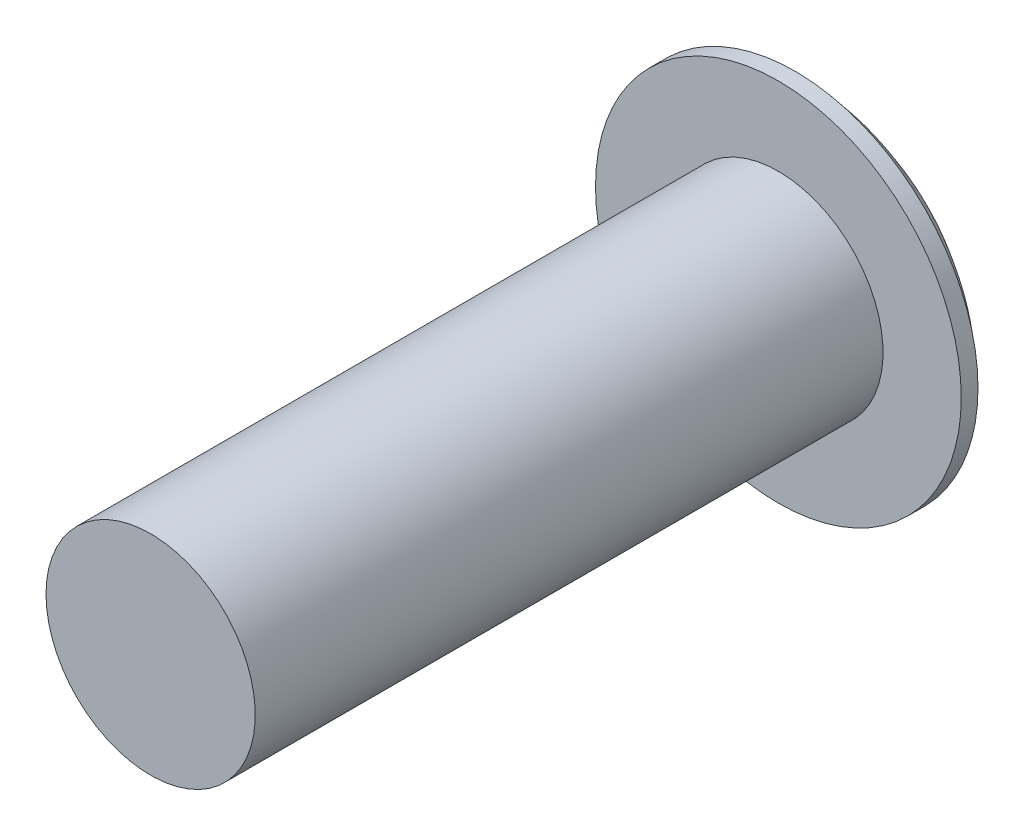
from build123d import *

# Parameters (mm, degrees)
SKETCH2_R      = 3.175
EXTRUDE1_DEPTH = 19.05
EXTRUDE2_DEPTH = 6.35


with BuildPart() as part:
    # Sketch1 → Revolve1 (revolve)
    with BuildSketch(Plane(origin=(0, 0, 0), x_dir=(0, 0, -1), z_dir=(1, 0, 0)), mode=Mode.PRIVATE) as revolve1_sk:
        with BuildLine():
            Line((0, 0), (3.3528, 0))
            ThreePointArc((3.3528, 0), (2.276365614, 2.952287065), (0.508, 5.5499))
            Line((0.508, 5.5499), (0, 5.5499))
            Line((0, 5.5499), (0, 0))
        make_face()
    revolve(revolve1_sk.sketch.rotate(Axis((0, 0, 0), (0, 0, -1)), 90), axis=Axis((0, 0, 0), (0, 0, -1)))

    # Sketch2 → Extrude1 (add)
    with BuildSketch(Plane.XY):
        with Locations(Location((0, 0, 0), (0, 0, 180))):
            Circle(SKETCH2_R)
    extrude(amount=EXTRUDE1_DEPTH)

    # Sketch3 → Extrude2 (cut)
    with BuildSketch(Plane.XY):
        Polygon((-1.083938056, 2.018762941), (-2.290269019, 0.070663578), (-1.206330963, -1.948099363), (1.083938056, -2.018762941), (2.290269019, -0.070663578), (1.206330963, 1.948099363), align=None)
    extrude(amount=-EXTRUDE2_DEPTH, mode=Mode.SUBTRACT)


solid = part.part
